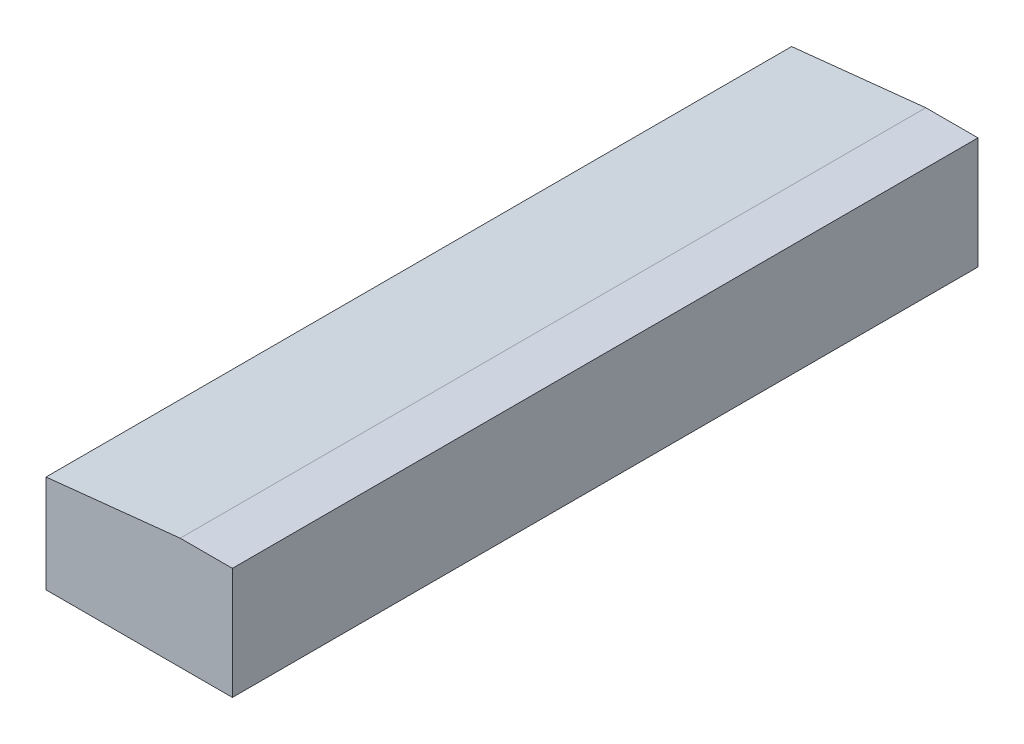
from build123d import *

# Parameters (mm, degrees)
EXTRUSION1_DEPTH = 100


with BuildPart() as part:
    # Esquisse1 → Extrusion1 (new body)
    with BuildSketch(Plane.XY):
        Polygon((0, 13.108123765), (18, 15), (25, 15), (25, 0), (0, 0), align=None)
    extrude(amount=EXTRUSION1_DEPTH)


solid = part.part
